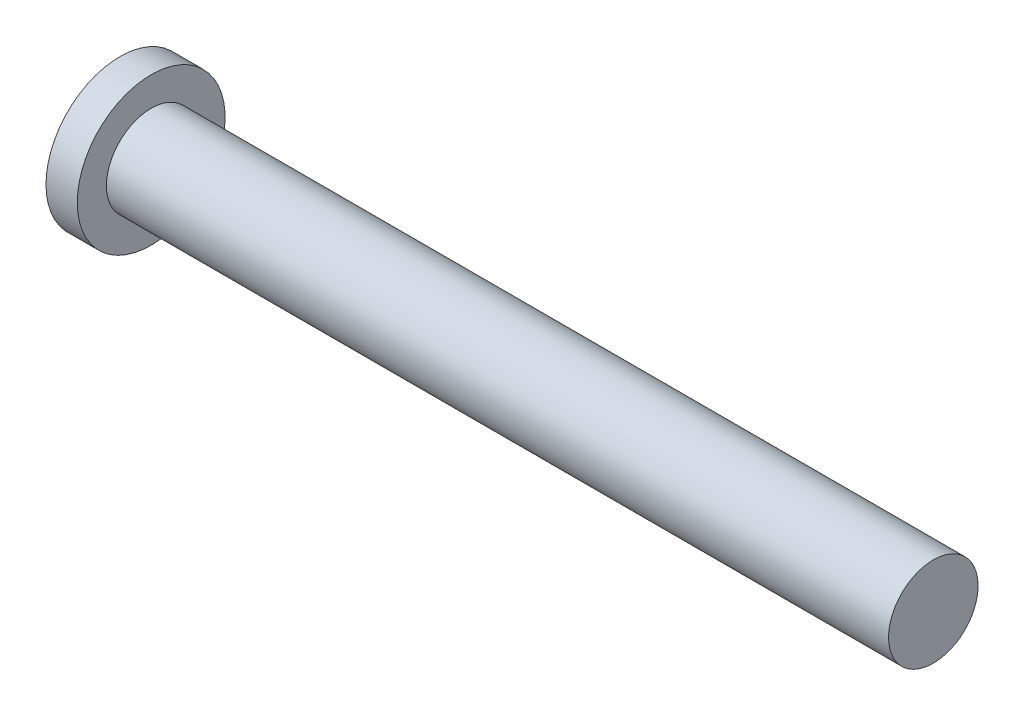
ISO-10303-21;
HEADER;
FILE_DESCRIPTION(('STEP AP214'),'2;1');
FILE_NAME('part.step','',(''),(''),'','','');
FILE_SCHEMA(('AUTOMOTIVE_DESIGN { 1 0 10303 214 1 1 1 1 }'));
ENDSEC;
DATA;
#1=APPLICATION_CONTEXT('core data for automotive mechanical design processes');
#2=APPLICATION_PROTOCOL_DEFINITION('international standard','automotive_design',2000,#1);
#3=PRODUCT_CONTEXT('',#1,'mechanical');
#4=PRODUCT('Part','Part','',(#3));
#5=PRODUCT_RELATED_PRODUCT_CATEGORY('part','',(#4));
#6=PRODUCT_DEFINITION_FORMATION('','',#4);
#7=PRODUCT_DEFINITION_CONTEXT('part definition',#1,'design');
#8=PRODUCT_DEFINITION('design','',#6,#7);
#9=PRODUCT_DEFINITION_SHAPE('','',#8);
#10=(LENGTH_UNIT() NAMED_UNIT(*) SI_UNIT(.MILLI.,.METRE.));
#11=(NAMED_UNIT(*) PLANE_ANGLE_UNIT() SI_UNIT($,.RADIAN.));
#12=(NAMED_UNIT(*) SI_UNIT($,.STERADIAN.) SOLID_ANGLE_UNIT());
#13=UNCERTAINTY_MEASURE_WITH_UNIT(LENGTH_MEASURE(1.E-05),#10,'distance_accuracy_value','');
#14=(GEOMETRIC_REPRESENTATION_CONTEXT(3) GLOBAL_UNCERTAINTY_ASSIGNED_CONTEXT((#13)) GLOBAL_UNIT_ASSIGNED_CONTEXT((#10,
#11,#12)) REPRESENTATION_CONTEXT('',''));
#15=CARTESIAN_POINT('',(0.,0.,0.));
#16=DIRECTION('',(0.,0.,1.));
#17=DIRECTION('',(1.,0.,0.));
#18=AXIS2_PLACEMENT_3D('',#15,#16,#17);
#19=CARTESIAN_POINT('',(165.1,0.,0.));
#20=DIRECTION('',(1.,0.,0.));
#21=DIRECTION('',(0.,0.,-1.));
#22=AXIS2_PLACEMENT_3D('',#19,#20,#21);
#23=PLANE('',#22);
#24=CARTESIAN_POINT('',(165.1,0.,0.));
#25=DIRECTION('',(-1.,0.,0.));
#26=DIRECTION('',(0.,0.,1.));
#27=AXIS2_PLACEMENT_3D('',#24,#25,#26);
#28=CIRCLE('',#27,9.0875);
#29=CARTESIAN_POINT('',(165.1,0.,9.0875));
#30=VERTEX_POINT('',#29);
#31=EDGE_CURVE('E10',#30,#30,#28,.T.);
#32=ORIENTED_EDGE('',*,*,#31,.F.);
#33=EDGE_LOOP('',(#32));
#34=FACE_BOUND('',#33,.T.);
#35=ADVANCED_FACE('F38',(#34),#23,.T.);
#36=CARTESIAN_POINT('',(0.,0.,0.));
#37=DIRECTION('',(-1.,0.,0.));
#38=DIRECTION('',(0.,0.,1.));
#39=AXIS2_PLACEMENT_3D('',#36,#37,#38);
#40=CYLINDRICAL_SURFACE('',#39,9.0875);
#41=ORIENTED_EDGE('',*,*,#31,.T.);
#42=EDGE_LOOP('',(#41));
#43=FACE_BOUND('',#42,.T.);
#44=CARTESIAN_POINT('',(6.35,0.,0.));
#45=DIRECTION('',(-1.,0.,0.));
#46=DIRECTION('',(0.,0.,1.));
#47=AXIS2_PLACEMENT_3D('',#44,#45,#46);
#48=CIRCLE('',#47,9.0875);
#49=CARTESIAN_POINT('',(6.35,0.,9.0875));
#50=VERTEX_POINT('',#49);
#51=EDGE_CURVE('E46',#50,#50,#48,.T.);
#52=ORIENTED_EDGE('',*,*,#51,.F.);
#53=EDGE_LOOP('',(#52));
#54=FACE_BOUND('',#53,.T.);
#55=ADVANCED_FACE('F84',(#43,#54),#40,.T.);
#56=CARTESIAN_POINT('',(6.35,0.,0.));
#57=DIRECTION('',(-1.,0.,0.));
#58=DIRECTION('',(0.,0.,1.));
#59=AXIS2_PLACEMENT_3D('',#56,#57,#58);
#60=PLANE('',#59);
#61=CARTESIAN_POINT('',(6.35,0.,0.));
#62=DIRECTION('',(-1.,0.,0.));
#63=DIRECTION('',(0.,0.,1.));
#64=AXIS2_PLACEMENT_3D('',#61,#62,#63);
#65=CIRCLE('',#64,15.);
#66=CARTESIAN_POINT('',(6.35,0.,15.));
#67=VERTEX_POINT('',#66);
#68=EDGE_CURVE('E50',#67,#67,#65,.T.);
#69=ORIENTED_EDGE('',*,*,#68,.F.);
#70=EDGE_LOOP('',(#69));
#71=FACE_BOUND('',#70,.T.);
#72=ORIENTED_EDGE('',*,*,#51,.T.);
#73=EDGE_LOOP('',(#72));
#74=FACE_BOUND('',#73,.T.);
#75=ADVANCED_FACE('F77',(#71,#74),#60,.F.);
#76=CARTESIAN_POINT('',(0.,0.,0.));
#77=DIRECTION('',(-1.,0.,0.));
#78=DIRECTION('',(0.,0.,1.));
#79=AXIS2_PLACEMENT_3D('',#76,#77,#78);
#80=CYLINDRICAL_SURFACE('',#79,15.);
#81=ORIENTED_EDGE('',*,*,#68,.T.);
#82=EDGE_LOOP('',(#81));
#83=FACE_BOUND('',#82,.T.);
#84=CARTESIAN_POINT('',(0.,0.,0.));
#85=DIRECTION('',(-1.,0.,0.));
#86=DIRECTION('',(0.,0.,1.));
#87=AXIS2_PLACEMENT_3D('',#84,#85,#86);
#88=CIRCLE('',#87,15.);
#89=CARTESIAN_POINT('',(0.,0.,15.));
#90=VERTEX_POINT('',#89);
#91=EDGE_CURVE('E54',#90,#90,#88,.T.);
#92=ORIENTED_EDGE('',*,*,#91,.F.);
#93=EDGE_LOOP('',(#92));
#94=FACE_BOUND('',#93,.T.);
#95=ADVANCED_FACE('F83',(#83,#94),#80,.T.);
#96=CARTESIAN_POINT('',(0.,0.,0.));
#97=DIRECTION('',(-1.,0.,0.));
#98=DIRECTION('',(0.,0.,1.));
#99=AXIS2_PLACEMENT_3D('',#96,#97,#98);
#100=PLANE('',#99);
#101=ORIENTED_EDGE('',*,*,#91,.T.);
#102=EDGE_LOOP('',(#101));
#103=FACE_BOUND('',#102,.T.);
#104=ADVANCED_FACE('F90',(#103),#100,.T.);
#105=CLOSED_SHELL('',(#35,#55,#75,#95,#104));
#106=CARTESIAN_POINT('',(158.75,0.,0.));
#107=DIRECTION('',(-1.,0.,0.));
#108=DIRECTION('',(0.,0.,1.));
#109=AXIS2_PLACEMENT_3D('',#106,#107,#108);
#110=PLANE('',#109);
#111=CARTESIAN_POINT('',(158.75,0.,0.));
#112=DIRECTION('',(-1.,0.,0.));
#113=DIRECTION('',(0.,0.,1.));
#114=AXIS2_PLACEMENT_3D('',#111,#112,#113);
#115=CIRCLE('',#114,7.5);
#116=CARTESIAN_POINT('',(158.75,0.,7.5));
#117=VERTEX_POINT('',#116);
#118=EDGE_CURVE('E62',#117,#117,#115,.T.);
#119=ORIENTED_EDGE('',*,*,#118,.T.);
#120=EDGE_LOOP('',(#119));
#121=FACE_BOUND('',#120,.T.);
#122=ADVANCED_FACE('F40',(#121),#110,.T.);
#123=CARTESIAN_POINT('',(6.35,0.,0.));
#124=DIRECTION('',(-1.,0.,0.));
#125=DIRECTION('',(0.,0.,1.));
#126=AXIS2_PLACEMENT_3D('',#123,#124,#125);
#127=CIRCLE('',#126,7.5);
#128=CARTESIAN_POINT('',(6.35,0.,7.5));
#129=VERTEX_POINT('',#128);
#130=EDGE_CURVE('E59',#129,#129,#127,.T.);
#131=ORIENTED_EDGE('',*,*,#130,.F.);
#132=EDGE_LOOP('',(#131));
#133=FACE_BOUND('',#132,.T.);
#134=ADVANCED_FACE('F70',(#133),#60,.F.);
#135=CARTESIAN_POINT('',(0.,0.,0.));
#136=DIRECTION('',(-1.,0.,0.));
#137=DIRECTION('',(0.,0.,1.));
#138=AXIS2_PLACEMENT_3D('',#135,#136,#137);
#139=CYLINDRICAL_SURFACE('',#138,7.5);
#140=ORIENTED_EDGE('',*,*,#118,.F.);
#141=EDGE_LOOP('',(#140));
#142=FACE_BOUND('',#141,.T.);
#143=ORIENTED_EDGE('',*,*,#130,.T.);
#144=EDGE_LOOP('',(#143));
#145=FACE_BOUND('',#144,.T.);
#146=ADVANCED_FACE('F67',(#142,#145),#139,.F.);
#147=CLOSED_SHELL('',(#122,#134,#146));
#148=ORIENTED_CLOSED_SHELL('',*,#147,.T.);
#149=BREP_WITH_VOIDS('B2',#105,(#148));
#150=ADVANCED_BREP_SHAPE_REPRESENTATION('',(#18,#149),#14);
#151=SHAPE_DEFINITION_REPRESENTATION(#9,#150);
ENDSEC;
END-ISO-10303-21;
